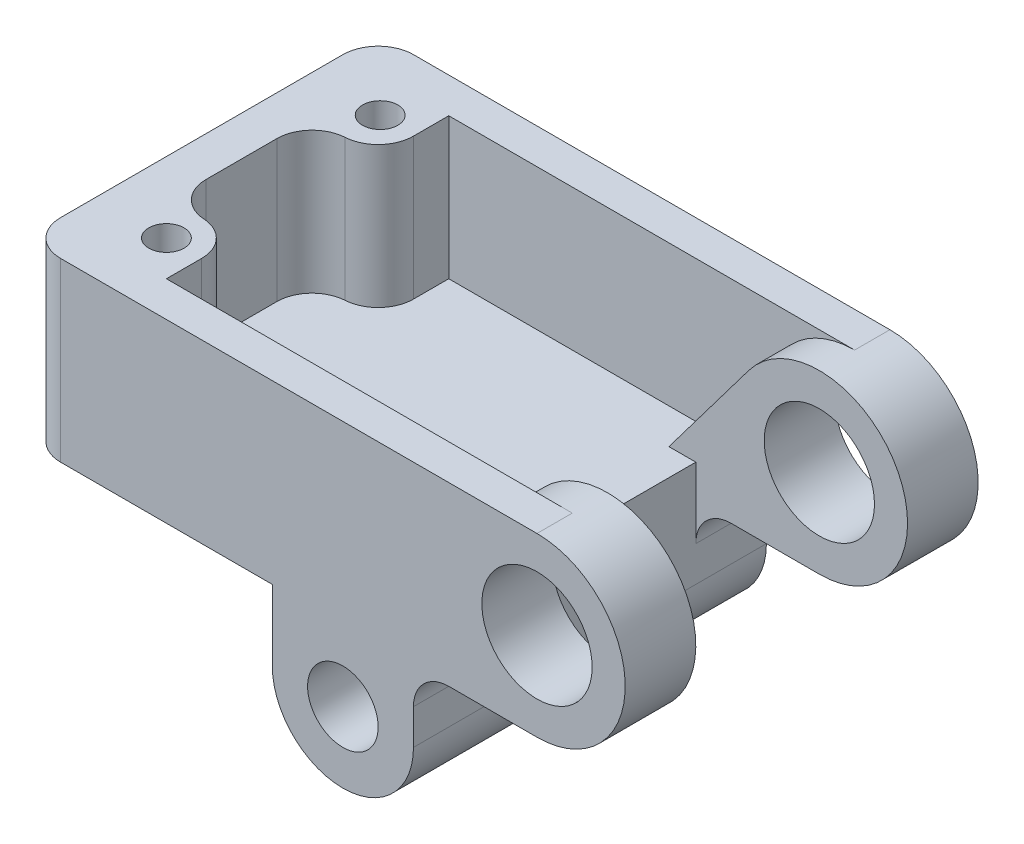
ISO-10303-21;
HEADER;
FILE_DESCRIPTION(('STEP AP214'),'2;1');
FILE_NAME('part.step','',(''),(''),'','','');
FILE_SCHEMA(('AUTOMOTIVE_DESIGN { 1 0 10303 214 1 1 1 1 }'));
ENDSEC;
DATA;
#1=APPLICATION_CONTEXT('core data for automotive mechanical design processes');
#2=APPLICATION_PROTOCOL_DEFINITION('international standard','automotive_design',2000,#1);
#3=PRODUCT_CONTEXT('',#1,'mechanical');
#4=PRODUCT('Part','Part','',(#3));
#5=PRODUCT_RELATED_PRODUCT_CATEGORY('part','',(#4));
#6=PRODUCT_DEFINITION_FORMATION('','',#4);
#7=PRODUCT_DEFINITION_CONTEXT('part definition',#1,'design');
#8=PRODUCT_DEFINITION('design','',#6,#7);
#9=PRODUCT_DEFINITION_SHAPE('','',#8);
#10=(LENGTH_UNIT() NAMED_UNIT(*) SI_UNIT(.MILLI.,.METRE.));
#11=(NAMED_UNIT(*) PLANE_ANGLE_UNIT() SI_UNIT($,.RADIAN.));
#12=(NAMED_UNIT(*) SI_UNIT($,.STERADIAN.) SOLID_ANGLE_UNIT());
#13=UNCERTAINTY_MEASURE_WITH_UNIT(LENGTH_MEASURE(1.E-05),#10,'distance_accuracy_value','');
#14=(GEOMETRIC_REPRESENTATION_CONTEXT(3) GLOBAL_UNCERTAINTY_ASSIGNED_CONTEXT((#13)) GLOBAL_UNIT_ASSIGNED_CONTEXT((#10,
#11,#12)) REPRESENTATION_CONTEXT('',''));
#15=CARTESIAN_POINT('',(0.,0.,0.));
#16=DIRECTION('',(0.,0.,1.));
#17=DIRECTION('',(1.,0.,0.));
#18=AXIS2_PLACEMENT_3D('',#15,#16,#17);
#19=CARTESIAN_POINT('',(0.,40.,40.));
#20=DIRECTION('',(1.,0.,0.));
#21=DIRECTION('',(0.,1.,0.));
#22=AXIS2_PLACEMENT_3D('',#19,#20,#21);
#23=PLANE('',#22);
#24=DIRECTION('',(0.,-1.,0.));
#25=VECTOR('',#24,1.);
#26=CARTESIAN_POINT('',(0.,0.,-16.));
#27=LINE('',#26,#25);
#28=CARTESIAN_POINT('',(0.,16.,-16.));
#29=VERTEX_POINT('',#28);
#30=CARTESIAN_POINT('',(0.,0.,-16.));
#31=VERTEX_POINT('',#30);
#32=EDGE_CURVE('E54',#29,#31,#27,.T.);
#33=ORIENTED_EDGE('',*,*,#32,.F.);
#34=CARTESIAN_POINT('',(0.,16.,0.));
#35=DIRECTION('',(-1.,0.,0.));
#36=DIRECTION('',(0.,1.,0.));
#37=AXIS2_PLACEMENT_3D('',#34,#35,#36);
#38=CIRCLE('',#37,16.);
#39=CARTESIAN_POINT('',(0.,16.,16.));
#40=VERTEX_POINT('',#39);
#41=EDGE_CURVE('E269',#40,#29,#38,.T.);
#42=ORIENTED_EDGE('',*,*,#41,.F.);
#43=DIRECTION('',(0.,1.,0.));
#44=VECTOR('',#43,1.);
#45=CARTESIAN_POINT('',(0.,0.,16.));
#46=LINE('',#45,#44);
#47=CARTESIAN_POINT('',(0.,0.,16.));
#48=VERTEX_POINT('',#47);
#49=EDGE_CURVE('E682',#48,#40,#46,.T.);
#50=ORIENTED_EDGE('',*,*,#49,.F.);
#51=DIRECTION('',(0.,0.,-1.));
#52=VECTOR('',#51,1.);
#53=CARTESIAN_POINT('',(0.,0.,40.));
#54=LINE('',#53,#52);
#55=CARTESIAN_POINT('',(0.,0.,32.));
#56=VERTEX_POINT('',#55);
#57=EDGE_CURVE('E538',#56,#48,#54,.T.);
#58=ORIENTED_EDGE('',*,*,#57,.F.);
#59=DIRECTION('',(0.,-1.,0.));
#60=VECTOR('',#59,1.);
#61=CARTESIAN_POINT('',(0.,40.,32.));
#62=LINE('',#61,#60);
#63=CARTESIAN_POINT('',(0.,40.,32.));
#64=VERTEX_POINT('',#63);
#65=EDGE_CURVE('E548',#56,#64,#62,.F.);
#66=ORIENTED_EDGE('',*,*,#65,.T.);
#67=DIRECTION('',(0.,0.,-1.));
#68=VECTOR('',#67,1.);
#69=CARTESIAN_POINT('',(0.,40.,40.));
#70=LINE('',#69,#68);
#71=CARTESIAN_POINT('',(0.,40.,-32.));
#72=VERTEX_POINT('',#71);
#73=EDGE_CURVE('E541',#64,#72,#70,.T.);
#74=ORIENTED_EDGE('',*,*,#73,.T.);
#75=DIRECTION('',(0.,-1.,0.));
#76=VECTOR('',#75,1.);
#77=CARTESIAN_POINT('',(0.,0.,-32.));
#78=LINE('',#77,#76);
#79=CARTESIAN_POINT('',(0.,0.,-32.));
#80=VERTEX_POINT('',#79);
#81=EDGE_CURVE('E551',#72,#80,#78,.T.);
#82=ORIENTED_EDGE('',*,*,#81,.T.);
#83=EDGE_CURVE('E537',#31,#80,#54,.T.);
#84=ORIENTED_EDGE('',*,*,#83,.F.);
#85=EDGE_LOOP('',(#33,#42,#50,#58,#66,#74,#82,#84));
#86=FACE_BOUND('',#85,.T.);
#87=ADVANCED_FACE('F38',(#86),#23,.F.);
#88=CARTESIAN_POINT('',(0.,40.,40.));
#89=DIRECTION('',(0.,-1.,0.));
#90=DIRECTION('',(1.,0.,0.));
#91=AXIS2_PLACEMENT_3D('',#88,#89,#90);
#92=PLANE('',#91);
#93=CARTESIAN_POINT('',(16.1058529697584,40.,-24.3492724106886));
#94=DIRECTION('',(0.,1.,0.));
#95=DIRECTION('',(0.,0.,1.));
#96=AXIS2_PLACEMENT_3D('',#93,#94,#95);
#97=CIRCLE('',#96,3.99999999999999);
#98=CARTESIAN_POINT('',(16.1058529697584,40.,-20.3492724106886));
#99=VERTEX_POINT('',#98);
#100=EDGE_CURVE('E273',#99,#99,#97,.T.);
#101=ORIENTED_EDGE('',*,*,#100,.F.);
#102=EDGE_LOOP('',(#101));
#103=FACE_BOUND('',#102,.T.);
#104=DIRECTION('',(-1.,0.,0.));
#105=VECTOR('',#104,1.);
#106=CARTESIAN_POINT('',(0.,40.,-40.));
#107=LINE('',#106,#105);
#108=CARTESIAN_POINT('',(116.,40.,-40.));
#109=VERTEX_POINT('',#108);
#110=CARTESIAN_POINT('',(8.,40.,-40.));
#111=VERTEX_POINT('',#110);
#112=EDGE_CURVE('E465',#109,#111,#107,.T.);
#113=ORIENTED_EDGE('',*,*,#112,.T.);
#114=CARTESIAN_POINT('',(8.,40.,-32.));
#115=DIRECTION('',(0.,-1.,0.));
#116=DIRECTION('',(1.,0.,0.));
#117=AXIS2_PLACEMENT_3D('',#114,#115,#116);
#118=CIRCLE('',#117,8.);
#119=EDGE_CURVE('E566',#111,#72,#118,.F.);
#120=ORIENTED_EDGE('',*,*,#119,.T.);
#121=ORIENTED_EDGE('',*,*,#73,.F.);
#122=CARTESIAN_POINT('',(8.00000000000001,40.,32.));
#123=DIRECTION('',(0.,-1.,0.));
#124=DIRECTION('',(1.,0.,0.));
#125=AXIS2_PLACEMENT_3D('',#122,#123,#124);
#126=CIRCLE('',#125,8.);
#127=CARTESIAN_POINT('',(8.00000000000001,40.,40.));
#128=VERTEX_POINT('',#127);
#129=EDGE_CURVE('E563',#64,#128,#126,.F.);
#130=ORIENTED_EDGE('',*,*,#129,.T.);
#131=DIRECTION('',(-1.,0.,0.));
#132=VECTOR('',#131,1.);
#133=CARTESIAN_POINT('',(0.,40.,40.));
#134=LINE('',#133,#132);
#135=CARTESIAN_POINT('',(116.,40.,40.));
#136=VERTEX_POINT('',#135);
#137=EDGE_CURVE('E469',#136,#128,#134,.T.);
#138=ORIENTED_EDGE('',*,*,#137,.F.);
#139=DIRECTION('',(0.,0.,-1.));
#140=VECTOR('',#139,1.);
#141=CARTESIAN_POINT('',(116.,40.,40.));
#142=LINE('',#141,#140);
#143=CARTESIAN_POINT('',(116.,40.,32.));
#144=VERTEX_POINT('',#143);
#145=EDGE_CURVE('E516',#136,#144,#142,.T.);
#146=ORIENTED_EDGE('',*,*,#145,.T.);
#147=DIRECTION('',(1.,0.,0.));
#148=VECTOR('',#147,1.);
#149=CARTESIAN_POINT('',(24.,40.,32.));
#150=LINE('',#149,#148);
#151=CARTESIAN_POINT('',(24.,40.,32.));
#152=VERTEX_POINT('',#151);
#153=EDGE_CURVE('E365',#152,#144,#150,.T.);
#154=ORIENTED_EDGE('',*,*,#153,.F.);
#155=DIRECTION('',(0.,0.,1.));
#156=VECTOR('',#155,1.);
#157=CARTESIAN_POINT('',(24.,40.,24.));
#158=LINE('',#157,#156);
#159=CARTESIAN_POINT('',(24.,40.,24.));
#160=VERTEX_POINT('',#159);
#161=EDGE_CURVE('E425',#160,#152,#158,.T.);
#162=ORIENTED_EDGE('',*,*,#161,.F.);
#163=CARTESIAN_POINT('',(16.,40.,24.));
#164=DIRECTION('',(0.,-1.,0.));
#165=DIRECTION('',(1.,0.,0.));
#166=AXIS2_PLACEMENT_3D('',#163,#164,#165);
#167=CIRCLE('',#166,8.);
#168=CARTESIAN_POINT('',(16.5,40.,16.0156402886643));
#169=VERTEX_POINT('',#168);
#170=EDGE_CURVE('E421',#169,#160,#167,.T.);
#171=ORIENTED_EDGE('',*,*,#170,.F.);
#172=CARTESIAN_POINT('',(17.,40.,8.03128057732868));
#173=DIRECTION('',(0.,1.,0.));
#174=DIRECTION('',(-1.,0.,0.));
#175=AXIS2_PLACEMENT_3D('',#172,#173,#174);
#176=CIRCLE('',#175,8.);
#177=CARTESIAN_POINT('',(9.,40.,8.03128057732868));
#178=VERTEX_POINT('',#177);
#179=EDGE_CURVE('E417',#178,#169,#176,.T.);
#180=ORIENTED_EDGE('',*,*,#179,.F.);
#181=DIRECTION('',(0.,0.,1.));
#182=VECTOR('',#181,1.);
#183=CARTESIAN_POINT('',(9.,40.,-8.03128057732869));
#184=LINE('',#183,#182);
#185=CARTESIAN_POINT('',(9.,40.,-8.03128057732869));
#186=VERTEX_POINT('',#185);
#187=EDGE_CURVE('E413',#186,#178,#184,.T.);
#188=ORIENTED_EDGE('',*,*,#187,.F.);
#189=CARTESIAN_POINT('',(17.,40.,-8.03128057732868));
#190=DIRECTION('',(0.,1.,0.));
#191=DIRECTION('',(1.,0.,0.));
#192=AXIS2_PLACEMENT_3D('',#189,#190,#191);
#193=CIRCLE('',#192,8.);
#194=CARTESIAN_POINT('',(16.5,40.,-16.0156402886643));
#195=VERTEX_POINT('',#194);
#196=EDGE_CURVE('E409',#195,#186,#193,.T.);
#197=ORIENTED_EDGE('',*,*,#196,.F.);
#198=CARTESIAN_POINT('',(16.,40.,-24.));
#199=DIRECTION('',(0.,-1.,0.));
#200=DIRECTION('',(1.,0.,0.));
#201=AXIS2_PLACEMENT_3D('',#198,#199,#200);
#202=CIRCLE('',#201,8.);
#203=CARTESIAN_POINT('',(24.,40.,-24.));
#204=VERTEX_POINT('',#203);
#205=EDGE_CURVE('E405',#204,#195,#202,.T.);
#206=ORIENTED_EDGE('',*,*,#205,.F.);
#207=DIRECTION('',(0.,0.,1.));
#208=VECTOR('',#207,1.);
#209=CARTESIAN_POINT('',(24.,40.,-32.));
#210=LINE('',#209,#208);
#211=CARTESIAN_POINT('',(24.,40.,-32.));
#212=VERTEX_POINT('',#211);
#213=EDGE_CURVE('E401',#212,#204,#210,.T.);
#214=ORIENTED_EDGE('',*,*,#213,.F.);
#215=DIRECTION('',(-1.,0.,0.));
#216=VECTOR('',#215,1.);
#217=CARTESIAN_POINT('',(150.373043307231,40.,-32.));
#218=LINE('',#217,#216);
#219=CARTESIAN_POINT('',(116.,40.,-32.));
#220=VERTEX_POINT('',#219);
#221=EDGE_CURVE('E398',#220,#212,#218,.T.);
#222=ORIENTED_EDGE('',*,*,#221,.F.);
#223=EDGE_CURVE('E493',#220,#109,#142,.T.);
#224=ORIENTED_EDGE('',*,*,#223,.T.);
#225=EDGE_LOOP('',(#113,#120,#121,#130,#138,#146,#154,#162,#171,#180,#188,#197,#206,#214,#222,#224));
#226=FACE_BOUND('',#225,.T.);
#227=CARTESIAN_POINT('',(16.,40.,24.));
#228=DIRECTION('',(0.,1.,0.));
#229=DIRECTION('',(0.,0.,1.));
#230=AXIS2_PLACEMENT_3D('',#227,#228,#229);
#231=CIRCLE('',#230,3.99999999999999);
#232=CARTESIAN_POINT('',(16.,40.,28.));
#233=VERTEX_POINT('',#232);
#234=EDGE_CURVE('E288',#233,#233,#231,.T.);
#235=ORIENTED_EDGE('',*,*,#234,.F.);
#236=EDGE_LOOP('',(#235));
#237=FACE_BOUND('',#236,.T.);
#238=ADVANCED_FACE('F660',(#103,#226,#237),#92,.F.);
#239=CARTESIAN_POINT('',(88.,-16.,40.));
#240=DIRECTION('',(-1.,0.,0.));
#241=DIRECTION('',(0.,0.,1.));
#242=AXIS2_PLACEMENT_3D('',#239,#240,#241);
#243=PLANE('',#242);
#244=DIRECTION('',(0.,1.,0.));
#245=VECTOR('',#244,1.);
#246=CARTESIAN_POINT('',(88.,-16.,-40.));
#247=LINE('',#246,#245);
#248=CARTESIAN_POINT('',(88.,-16.,-40.));
#249=VERTEX_POINT('',#248);
#250=CARTESIAN_POINT('',(88.,-8.,-40.));
#251=VERTEX_POINT('',#250);
#252=EDGE_CURVE('E506',#249,#251,#247,.T.);
#253=ORIENTED_EDGE('',*,*,#252,.T.);
#254=DIRECTION('',(0.,0.,-1.));
#255=VECTOR('',#254,1.);
#256=CARTESIAN_POINT('',(88.,-8.,-24.));
#257=LINE('',#256,#255);
#258=CARTESIAN_POINT('',(88.,-8.,-24.));
#259=VERTEX_POINT('',#258);
#260=EDGE_CURVE('E580',#251,#259,#257,.F.);
#261=ORIENTED_EDGE('',*,*,#260,.T.);
#262=DIRECTION('',(0.,-1.,0.));
#263=VECTOR('',#262,1.);
#264=CARTESIAN_POINT('',(88.,0.,-24.));
#265=LINE('',#264,#263);
#266=CARTESIAN_POINT('',(88.,8.,-24.));
#267=VERTEX_POINT('',#266);
#268=EDGE_CURVE('E333',#267,#259,#265,.T.);
#269=ORIENTED_EDGE('',*,*,#268,.F.);
#270=DIRECTION('',(0.,0.,1.));
#271=VECTOR('',#270,1.);
#272=CARTESIAN_POINT('',(88.,8.,-32.));
#273=LINE('',#272,#271);
#274=CARTESIAN_POINT('',(88.,8.,24.));
#275=VERTEX_POINT('',#274);
#276=EDGE_CURVE('E361',#267,#275,#273,.T.);
#277=ORIENTED_EDGE('',*,*,#276,.T.);
#278=DIRECTION('',(0.,-1.,0.));
#279=VECTOR('',#278,1.);
#280=CARTESIAN_POINT('',(88.,0.,24.));
#281=LINE('',#280,#279);
#282=CARTESIAN_POINT('',(88.,-8.,24.));
#283=VERTEX_POINT('',#282);
#284=EDGE_CURVE('E301',#275,#283,#281,.T.);
#285=ORIENTED_EDGE('',*,*,#284,.T.);
#286=DIRECTION('',(0.,0.,-1.));
#287=VECTOR('',#286,1.);
#288=CARTESIAN_POINT('',(88.,-8.,40.));
#289=LINE('',#288,#287);
#290=CARTESIAN_POINT('',(88.,-8.,40.));
#291=VERTEX_POINT('',#290);
#292=EDGE_CURVE('E577',#283,#291,#289,.F.);
#293=ORIENTED_EDGE('',*,*,#292,.T.);
#294=DIRECTION('',(0.,1.,0.));
#295=VECTOR('',#294,1.);
#296=CARTESIAN_POINT('',(88.,-16.,40.));
#297=LINE('',#296,#295);
#298=CARTESIAN_POINT('',(88.,-16.,40.));
#299=VERTEX_POINT('',#298);
#300=EDGE_CURVE('E483',#299,#291,#297,.T.);
#301=ORIENTED_EDGE('',*,*,#300,.F.);
#302=DIRECTION('',(0.,0.,-1.));
#303=VECTOR('',#302,1.);
#304=CARTESIAN_POINT('',(88.,-16.,40.));
#305=LINE('',#304,#303);
#306=EDGE_CURVE('E525',#299,#249,#305,.T.);
#307=ORIENTED_EDGE('',*,*,#306,.T.);
#308=EDGE_LOOP('',(#253,#261,#269,#277,#285,#293,#301,#307));
#309=FACE_BOUND('',#308,.T.);
#310=ADVANCED_FACE('F603',(#309),#243,.F.);
#311=CARTESIAN_POINT('',(150.373043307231,-155.18484904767,-32.));
#312=DIRECTION('',(0.,0.,-1.));
#313=DIRECTION('',(-1.,0.,0.));
#314=AXIS2_PLACEMENT_3D('',#311,#312,#313);
#315=PLANE('',#314);
#316=CARTESIAN_POINT('',(116.,20.,-32.));
#317=DIRECTION('',(0.,0.,1.));
#318=DIRECTION('',(-1.,0.,0.));
#319=AXIS2_PLACEMENT_3D('',#316,#317,#318);
#320=CIRCLE('',#319,20.);
#321=CARTESIAN_POINT('',(100.027289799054,32.0363004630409,-32.));
#322=VERTEX_POINT('',#321);
#323=EDGE_CURVE('E332',#220,#322,#320,.T.);
#324=ORIENTED_EDGE('',*,*,#323,.F.);
#325=ORIENTED_EDGE('',*,*,#221,.T.);
#326=DIRECTION('',(0.,1.,0.));
#327=VECTOR('',#326,1.);
#328=CARTESIAN_POINT('',(24.,-155.18484904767,-32.));
#329=LINE('',#328,#327);
#330=CARTESIAN_POINT('',(24.,8.00000000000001,-32.));
#331=VERTEX_POINT('',#330);
#332=EDGE_CURVE('E429',#331,#212,#329,.T.);
#333=ORIENTED_EDGE('',*,*,#332,.F.);
#334=DIRECTION('',(1.,0.,0.));
#335=VECTOR('',#334,1.);
#336=CARTESIAN_POINT('',(150.373043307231,8.00000000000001,-32.));
#337=LINE('',#336,#335);
#338=CARTESIAN_POINT('',(81.914638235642,8.00000000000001,-32.));
#339=VERTEX_POINT('',#338);
#340=EDGE_CURVE('E366',#331,#339,#337,.T.);
#341=ORIENTED_EDGE('',*,*,#340,.T.);
#342=DIRECTION('',(-0.601815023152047,-0.798635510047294,0.));
#343=VECTOR('',#342,1.);
#344=CARTESIAN_POINT('',(81.914638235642,8.,-32.));
#345=LINE('',#344,#343);
#346=EDGE_CURVE('E337',#322,#339,#345,.T.);
#347=ORIENTED_EDGE('',*,*,#346,.F.);
#348=EDGE_LOOP('',(#324,#325,#333,#341,#347));
#349=FACE_BOUND('',#348,.T.);
#350=ADVANCED_FACE('F768',(#349),#315,.F.);
#351=CARTESIAN_POINT('',(0.,8.,40.));
#352=DIRECTION('',(0.,1.,0.));
#353=DIRECTION('',(0.,0.,1.));
#354=AXIS2_PLACEMENT_3D('',#351,#352,#353);
#355=PLANE('',#354);
#356=DIRECTION('',(0.,0.,1.));
#357=VECTOR('',#356,1.);
#358=CARTESIAN_POINT('',(81.914638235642,8.,24.));
#359=LINE('',#358,#357);
#360=CARTESIAN_POINT('',(81.914638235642,8.,24.));
#361=VERTEX_POINT('',#360);
#362=CARTESIAN_POINT('',(81.914638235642,8.00000000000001,32.));
#363=VERTEX_POINT('',#362);
#364=EDGE_CURVE('E324',#361,#363,#359,.T.);
#365=ORIENTED_EDGE('',*,*,#364,.F.);
#366=DIRECTION('',(1.,0.,0.));
#367=VECTOR('',#366,1.);
#368=CARTESIAN_POINT('',(81.914638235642,8.,24.));
#369=LINE('',#368,#367);
#370=EDGE_CURVE('E304',#361,#275,#369,.T.);
#371=ORIENTED_EDGE('',*,*,#370,.T.);
#372=ORIENTED_EDGE('',*,*,#276,.F.);
#373=DIRECTION('',(1.,0.,0.));
#374=VECTOR('',#373,1.);
#375=CARTESIAN_POINT('',(81.914638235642,8.,-24.));
#376=LINE('',#375,#374);
#377=CARTESIAN_POINT('',(81.914638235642,8.,-24.));
#378=VERTEX_POINT('',#377);
#379=EDGE_CURVE('E346',#378,#267,#376,.T.);
#380=ORIENTED_EDGE('',*,*,#379,.F.);
#381=DIRECTION('',(0.,0.,-1.));
#382=VECTOR('',#381,1.);
#383=CARTESIAN_POINT('',(81.914638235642,8.,-24.));
#384=LINE('',#383,#382);
#385=EDGE_CURVE('E349',#378,#339,#384,.T.);
#386=ORIENTED_EDGE('',*,*,#385,.T.);
#387=ORIENTED_EDGE('',*,*,#340,.F.);
#388=DIRECTION('',(0.,0.,-1.));
#389=VECTOR('',#388,1.);
#390=CARTESIAN_POINT('',(24.,8.00000000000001,-32.));
#391=LINE('',#390,#389);
#392=CARTESIAN_POINT('',(24.,8.00000000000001,-24.));
#393=VERTEX_POINT('',#392);
#394=EDGE_CURVE('E370',#393,#331,#391,.T.);
#395=ORIENTED_EDGE('',*,*,#394,.F.);
#396=CARTESIAN_POINT('',(16.,8.00000000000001,-24.));
#397=DIRECTION('',(0.,1.,0.));
#398=DIRECTION('',(0.,0.,1.));
#399=AXIS2_PLACEMENT_3D('',#396,#397,#398);
#400=CIRCLE('',#399,8.);
#401=CARTESIAN_POINT('',(16.5,8.00000000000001,-16.0156402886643));
#402=VERTEX_POINT('',#401);
#403=EDGE_CURVE('E374',#402,#393,#400,.T.);
#404=ORIENTED_EDGE('',*,*,#403,.F.);
#405=CARTESIAN_POINT('',(17.,8.00000000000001,-8.03128057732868));
#406=DIRECTION('',(0.,1.,0.));
#407=DIRECTION('',(0.,0.,1.));
#408=AXIS2_PLACEMENT_3D('',#405,#406,#407);
#409=CIRCLE('',#408,8.);
#410=CARTESIAN_POINT('',(9.,8.00000000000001,-8.03128057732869));
#411=VERTEX_POINT('',#410);
#412=EDGE_CURVE('E377',#411,#402,#409,.F.);
#413=ORIENTED_EDGE('',*,*,#412,.F.);
#414=DIRECTION('',(0.,0.,-1.));
#415=VECTOR('',#414,1.);
#416=CARTESIAN_POINT('',(9.,8.00000000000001,-8.03128057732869));
#417=LINE('',#416,#415);
#418=CARTESIAN_POINT('',(9.00000000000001,8.00000000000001,8.03128057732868));
#419=VERTEX_POINT('',#418);
#420=EDGE_CURVE('E380',#419,#411,#417,.T.);
#421=ORIENTED_EDGE('',*,*,#420,.F.);
#422=CARTESIAN_POINT('',(17.,8.00000000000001,8.03128057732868));
#423=DIRECTION('',(0.,1.,0.));
#424=DIRECTION('',(0.,0.,1.));
#425=AXIS2_PLACEMENT_3D('',#422,#423,#424);
#426=CIRCLE('',#425,8.);
#427=CARTESIAN_POINT('',(16.5,8.00000000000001,16.0156402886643));
#428=VERTEX_POINT('',#427);
#429=EDGE_CURVE('E383',#428,#419,#426,.F.);
#430=ORIENTED_EDGE('',*,*,#429,.F.);
#431=CARTESIAN_POINT('',(16.,8.00000000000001,24.));
#432=DIRECTION('',(0.,1.,0.));
#433=DIRECTION('',(0.,0.,1.));
#434=AXIS2_PLACEMENT_3D('',#431,#432,#433);
#435=CIRCLE('',#434,8.);
#436=CARTESIAN_POINT('',(24.,8.00000000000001,24.));
#437=VERTEX_POINT('',#436);
#438=EDGE_CURVE('E386',#437,#428,#435,.T.);
#439=ORIENTED_EDGE('',*,*,#438,.F.);
#440=DIRECTION('',(0.,0.,-1.));
#441=VECTOR('',#440,1.);
#442=CARTESIAN_POINT('',(24.,8.00000000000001,24.));
#443=LINE('',#442,#441);
#444=CARTESIAN_POINT('',(24.,8.00000000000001,32.));
#445=VERTEX_POINT('',#444);
#446=EDGE_CURVE('E389',#445,#437,#443,.T.);
#447=ORIENTED_EDGE('',*,*,#446,.F.);
#448=DIRECTION('',(-1.,0.,0.));
#449=VECTOR('',#448,1.);
#450=CARTESIAN_POINT('',(24.,8.00000000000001,32.));
#451=LINE('',#450,#449);
#452=EDGE_CURVE('E392',#363,#445,#451,.T.);
#453=ORIENTED_EDGE('',*,*,#452,.F.);
#454=EDGE_LOOP('',(#365,#371,#372,#380,#386,#387,#395,#404,#413,#421,#430,#439,#447,#453));
#455=FACE_BOUND('',#454,.T.);
#456=ADVANCED_FACE('F642',(#455),#355,.T.);
#457=CARTESIAN_POINT('',(116.,20.,40.));
#458=DIRECTION('',(0.,0.,-1.));
#459=DIRECTION('',(-1.,0.,0.));
#460=AXIS2_PLACEMENT_3D('',#457,#458,#459);
#461=CYLINDRICAL_SURFACE('',#460,12.5);
#462=CARTESIAN_POINT('',(116.,20.,-40.));
#463=DIRECTION('',(0.,0.,1.));
#464=DIRECTION('',(1.,0.,0.));
#465=AXIS2_PLACEMENT_3D('',#462,#463,#464);
#466=CIRCLE('',#465,12.5);
#467=CARTESIAN_POINT('',(128.5,20.,-40.));
#468=VERTEX_POINT('',#467);
#469=EDGE_CURVE('E395',#468,#468,#466,.T.);
#470=ORIENTED_EDGE('',*,*,#469,.F.);
#471=EDGE_LOOP('',(#470));
#472=FACE_BOUND('',#471,.T.);
#473=CARTESIAN_POINT('',(116.,20.,-24.));
#474=DIRECTION('',(0.,0.,1.));
#475=DIRECTION('',(1.,0.,0.));
#476=AXIS2_PLACEMENT_3D('',#473,#474,#475);
#477=CIRCLE('',#476,12.5);
#478=CARTESIAN_POINT('',(128.5,20.,-24.));
#479=VERTEX_POINT('',#478);
#480=EDGE_CURVE('E328',#479,#479,#477,.T.);
#481=ORIENTED_EDGE('',*,*,#480,.T.);
#482=EDGE_LOOP('',(#481));
#483=FACE_BOUND('',#482,.T.);
#484=ADVANCED_FACE('F767',(#472,#483),#461,.F.);
#485=CARTESIAN_POINT('',(116.,0.,40.));
#486=DIRECTION('',(0.,1.,0.));
#487=DIRECTION('',(0.,0.,1.));
#488=AXIS2_PLACEMENT_3D('',#485,#486,#487);
#489=PLANE('',#488);
#490=DIRECTION('',(1.,0.,0.));
#491=VECTOR('',#490,1.);
#492=CARTESIAN_POINT('',(88.,0.,-24.));
#493=LINE('',#492,#491);
#494=CARTESIAN_POINT('',(96.,0.,-24.));
#495=VERTEX_POINT('',#494);
#496=CARTESIAN_POINT('',(116.,0.,-24.));
#497=VERTEX_POINT('',#496);
#498=EDGE_CURVE('E336',#495,#497,#493,.T.);
#499=ORIENTED_EDGE('',*,*,#498,.F.);
#500=DIRECTION('',(0.,0.,-1.));
#501=VECTOR('',#500,1.);
#502=CARTESIAN_POINT('',(96.,0.,-40.));
#503=LINE('',#502,#501);
#504=CARTESIAN_POINT('',(96.,0.,-40.));
#505=VERTEX_POINT('',#504);
#506=EDGE_CURVE('E573',#495,#505,#503,.T.);
#507=ORIENTED_EDGE('',*,*,#506,.T.);
#508=DIRECTION('',(1.,0.,0.));
#509=VECTOR('',#508,1.);
#510=CARTESIAN_POINT('',(116.,0.,-40.));
#511=LINE('',#510,#509);
#512=CARTESIAN_POINT('',(116.,0.,-40.));
#513=VERTEX_POINT('',#512);
#514=EDGE_CURVE('E510',#505,#513,#511,.T.);
#515=ORIENTED_EDGE('',*,*,#514,.T.);
#516=DIRECTION('',(0.,0.,-1.));
#517=VECTOR('',#516,1.);
#518=CARTESIAN_POINT('',(116.,0.,40.));
#519=LINE('',#518,#517);
#520=EDGE_CURVE('E520',#497,#513,#519,.T.);
#521=ORIENTED_EDGE('',*,*,#520,.F.);
#522=EDGE_LOOP('',(#499,#507,#515,#521));
#523=FACE_BOUND('',#522,.T.);
#524=ADVANCED_FACE('F630',(#523),#489,.F.);
#525=CARTESIAN_POINT('',(116.,20.,40.));
#526=DIRECTION('',(0.,0.,-1.));
#527=DIRECTION('',(-1.,0.,0.));
#528=AXIS2_PLACEMENT_3D('',#525,#526,#527);
#529=CYLINDRICAL_SURFACE('',#528,20.);
#530=ORIENTED_EDGE('',*,*,#223,.F.);
#531=ORIENTED_EDGE('',*,*,#323,.T.);
#532=DIRECTION('',(0.,0.,-1.));
#533=VECTOR('',#532,1.);
#534=CARTESIAN_POINT('',(100.027289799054,32.0363004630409,-24.));
#535=LINE('',#534,#533);
#536=CARTESIAN_POINT('',(100.027289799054,32.0363004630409,-24.));
#537=VERTEX_POINT('',#536);
#538=EDGE_CURVE('E357',#537,#322,#535,.T.);
#539=ORIENTED_EDGE('',*,*,#538,.F.);
#540=CARTESIAN_POINT('',(116.,20.,-24.));
#541=DIRECTION('',(0.,0.,1.));
#542=DIRECTION('',(1.,0.,0.));
#543=AXIS2_PLACEMENT_3D('',#540,#541,#542);
#544=CIRCLE('',#543,20.);
#545=EDGE_CURVE('E340',#497,#537,#544,.T.);
#546=ORIENTED_EDGE('',*,*,#545,.F.);
#547=ORIENTED_EDGE('',*,*,#520,.T.);
#548=CARTESIAN_POINT('',(116.,20.,-40.));
#549=DIRECTION('',(0.,0.,1.));
#550=DIRECTION('',(-1.,0.,0.));
#551=AXIS2_PLACEMENT_3D('',#548,#549,#550);
#552=CIRCLE('',#551,20.);
#553=EDGE_CURVE('E474',#513,#109,#552,.T.);
#554=ORIENTED_EDGE('',*,*,#553,.T.);
#555=EDGE_LOOP('',(#530,#531,#539,#546,#547,#554));
#556=FACE_BOUND('',#555,.T.);
#557=ADVANCED_FACE('F807',(#556),#529,.T.);
#558=CARTESIAN_POINT('',(116.,20.,40.));
#559=DIRECTION('',(0.,0.,1.));
#560=DIRECTION('',(1.,0.,0.));
#561=AXIS2_PLACEMENT_3D('',#558,#559,#560);
#562=CIRCLE('',#561,12.5);
#563=CARTESIAN_POINT('',(128.5,20.,40.));
#564=VERTEX_POINT('',#563);
#565=EDGE_CURVE('E453',#564,#564,#562,.T.);
#566=ORIENTED_EDGE('',*,*,#565,.T.);
#567=EDGE_LOOP('',(#566));
#568=FACE_BOUND('',#567,.T.);
#569=CARTESIAN_POINT('',(116.,20.,24.));
#570=DIRECTION('',(0.,0.,1.));
#571=DIRECTION('',(1.,0.,0.));
#572=AXIS2_PLACEMENT_3D('',#569,#570,#571);
#573=CIRCLE('',#572,12.5);
#574=CARTESIAN_POINT('',(128.5,20.,24.));
#575=VERTEX_POINT('',#574);
#576=EDGE_CURVE('E296',#575,#575,#573,.T.);
#577=ORIENTED_EDGE('',*,*,#576,.F.);
#578=EDGE_LOOP('',(#577));
#579=FACE_BOUND('',#578,.T.);
#580=ADVANCED_FACE('F804',(#568,#579),#461,.F.);
#581=CARTESIAN_POINT('',(116.,20.,40.));
#582=DIRECTION('',(0.,0.,-1.));
#583=DIRECTION('',(-1.,0.,0.));
#584=AXIS2_PLACEMENT_3D('',#581,#582,#583);
#585=PLANE('',#584);
#586=CARTESIAN_POINT('',(72.,-16.,40.));
#587=DIRECTION('',(0.,0.,1.));
#588=DIRECTION('',(1.,0.,0.));
#589=AXIS2_PLACEMENT_3D('',#586,#587,#588);
#590=CIRCLE('',#589,8.);
#591=CARTESIAN_POINT('',(80.,-16.,40.));
#592=VERTEX_POINT('',#591);
#593=EDGE_CURVE('E461',#592,#592,#590,.T.);
#594=ORIENTED_EDGE('',*,*,#593,.F.);
#595=EDGE_LOOP('',(#594));
#596=FACE_BOUND('',#595,.T.);
#597=ORIENTED_EDGE('',*,*,#137,.T.);
#598=DIRECTION('',(0.,-1.,0.));
#599=VECTOR('',#598,1.);
#600=CARTESIAN_POINT('',(8.00000000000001,20.,40.));
#601=LINE('',#600,#599);
#602=CARTESIAN_POINT('',(8.,0.,40.));
#603=VERTEX_POINT('',#602);
#604=EDGE_CURVE('E569',#128,#603,#601,.T.);
#605=ORIENTED_EDGE('',*,*,#604,.T.);
#606=DIRECTION('',(1.,0.,0.));
#607=VECTOR('',#606,1.);
#608=CARTESIAN_POINT('',(0.,0.,40.));
#609=LINE('',#608,#607);
#610=CARTESIAN_POINT('',(56.,0.,40.));
#611=VERTEX_POINT('',#610);
#612=EDGE_CURVE('E473',#603,#611,#609,.T.);
#613=ORIENTED_EDGE('',*,*,#612,.T.);
#614=DIRECTION('',(0.,-1.,0.));
#615=VECTOR('',#614,1.);
#616=CARTESIAN_POINT('',(56.,0.,40.));
#617=LINE('',#616,#615);
#618=CARTESIAN_POINT('',(56.,-16.,40.));
#619=VERTEX_POINT('',#618);
#620=EDGE_CURVE('E477',#611,#619,#617,.T.);
#621=ORIENTED_EDGE('',*,*,#620,.T.);
#622=CARTESIAN_POINT('',(72.,-16.,40.));
#623=DIRECTION('',(0.,0.,1.));
#624=DIRECTION('',(1.,0.,0.));
#625=AXIS2_PLACEMENT_3D('',#622,#623,#624);
#626=CIRCLE('',#625,16.);
#627=EDGE_CURVE('E480',#619,#299,#626,.T.);
#628=ORIENTED_EDGE('',*,*,#627,.T.);
#629=ORIENTED_EDGE('',*,*,#300,.T.);
#630=CARTESIAN_POINT('',(96.,-8.,40.));
#631=DIRECTION('',(0.,0.,-1.));
#632=DIRECTION('',(-1.,0.,0.));
#633=AXIS2_PLACEMENT_3D('',#630,#631,#632);
#634=CIRCLE('',#633,8.);
#635=CARTESIAN_POINT('',(96.,0.,40.));
#636=VERTEX_POINT('',#635);
#637=EDGE_CURVE('E12',#291,#636,#634,.T.);
#638=ORIENTED_EDGE('',*,*,#637,.T.);
#639=DIRECTION('',(1.,0.,0.));
#640=VECTOR('',#639,1.);
#641=CARTESIAN_POINT('',(116.,0.,40.));
#642=LINE('',#641,#640);
#643=CARTESIAN_POINT('',(116.,0.,40.));
#644=VERTEX_POINT('',#643);
#645=EDGE_CURVE('E487',#636,#644,#642,.T.);
#646=ORIENTED_EDGE('',*,*,#645,.T.);
#647=CARTESIAN_POINT('',(116.,20.,40.));
#648=DIRECTION('',(0.,0.,1.));
#649=DIRECTION('',(-1.,0.,0.));
#650=AXIS2_PLACEMENT_3D('',#647,#648,#649);
#651=CIRCLE('',#650,20.);
#652=EDGE_CURVE('E490',#644,#136,#651,.T.);
#653=ORIENTED_EDGE('',*,*,#652,.T.);
#654=EDGE_LOOP('',(#597,#605,#613,#621,#628,#629,#638,#646,#653));
#655=FACE_BOUND('',#654,.T.);
#656=ORIENTED_EDGE('',*,*,#565,.F.);
#657=EDGE_LOOP('',(#656));
#658=FACE_BOUND('',#657,.T.);
#659=ADVANCED_FACE('F605',(#596,#655,#658),#585,.F.);
#660=CARTESIAN_POINT('',(116.,20.,-40.));
#661=DIRECTION('',(0.,0.,-1.));
#662=DIRECTION('',(-1.,0.,0.));
#663=AXIS2_PLACEMENT_3D('',#660,#661,#662);
#664=PLANE('',#663);
#665=CARTESIAN_POINT('',(72.,-16.,-40.));
#666=DIRECTION('',(0.,0.,1.));
#667=DIRECTION('',(1.,0.,0.));
#668=AXIS2_PLACEMENT_3D('',#665,#666,#667);
#669=CIRCLE('',#668,8.);
#670=CARTESIAN_POINT('',(80.,-16.,-40.));
#671=VERTEX_POINT('',#670);
#672=EDGE_CURVE('E457',#671,#671,#669,.T.);
#673=ORIENTED_EDGE('',*,*,#672,.T.);
#674=EDGE_LOOP('',(#673));
#675=FACE_BOUND('',#674,.T.);
#676=DIRECTION('',(1.,0.,0.));
#677=VECTOR('',#676,1.);
#678=CARTESIAN_POINT('',(0.,0.,-40.));
#679=LINE('',#678,#677);
#680=CARTESIAN_POINT('',(8.,0.,-40.));
#681=VERTEX_POINT('',#680);
#682=CARTESIAN_POINT('',(56.,0.,-40.));
#683=VERTEX_POINT('',#682);
#684=EDGE_CURVE('E497',#681,#683,#679,.T.);
#685=ORIENTED_EDGE('',*,*,#684,.F.);
#686=DIRECTION('',(0.,-1.,0.));
#687=VECTOR('',#686,1.);
#688=CARTESIAN_POINT('',(8.,40.,-40.));
#689=LINE('',#688,#687);
#690=EDGE_CURVE('E560',#681,#111,#689,.F.);
#691=ORIENTED_EDGE('',*,*,#690,.T.);
#692=ORIENTED_EDGE('',*,*,#112,.F.);
#693=ORIENTED_EDGE('',*,*,#553,.F.);
#694=ORIENTED_EDGE('',*,*,#514,.F.);
#695=CARTESIAN_POINT('',(96.,-8.,-40.));
#696=DIRECTION('',(0.,0.,-1.));
#697=DIRECTION('',(-1.,0.,0.));
#698=AXIS2_PLACEMENT_3D('',#695,#696,#697);
#699=CIRCLE('',#698,8.);
#700=EDGE_CURVE('E587',#505,#251,#699,.F.);
#701=ORIENTED_EDGE('',*,*,#700,.T.);
#702=ORIENTED_EDGE('',*,*,#252,.F.);
#703=CARTESIAN_POINT('',(72.,-16.,-40.));
#704=DIRECTION('',(0.,0.,1.));
#705=DIRECTION('',(1.,0.,0.));
#706=AXIS2_PLACEMENT_3D('',#703,#704,#705);
#707=CIRCLE('',#706,16.);
#708=CARTESIAN_POINT('',(56.,-16.,-40.));
#709=VERTEX_POINT('',#708);
#710=EDGE_CURVE('E503',#709,#249,#707,.T.);
#711=ORIENTED_EDGE('',*,*,#710,.F.);
#712=DIRECTION('',(0.,-1.,0.));
#713=VECTOR('',#712,1.);
#714=CARTESIAN_POINT('',(56.,0.,-40.));
#715=LINE('',#714,#713);
#716=EDGE_CURVE('E500',#683,#709,#715,.T.);
#717=ORIENTED_EDGE('',*,*,#716,.F.);
#718=EDGE_LOOP('',(#685,#691,#692,#693,#694,#701,#702,#711,#717));
#719=FACE_BOUND('',#718,.T.);
#720=ORIENTED_EDGE('',*,*,#469,.T.);
#721=EDGE_LOOP('',(#720));
#722=FACE_BOUND('',#721,.T.);
#723=ADVANCED_FACE('F619',(#675,#719,#722),#664,.T.);
#724=CARTESIAN_POINT('',(0.,0.,40.));
#725=DIRECTION('',(0.,1.,0.));
#726=DIRECTION('',(0.,0.,1.));
#727=AXIS2_PLACEMENT_3D('',#724,#725,#726);
#728=PLANE('',#727);
#729=CARTESIAN_POINT('',(16.1058529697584,0.,-24.3492724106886));
#730=DIRECTION('',(0.,1.,0.));
#731=DIRECTION('',(0.,0.,1.));
#732=AXIS2_PLACEMENT_3D('',#729,#730,#731);
#733=CIRCLE('',#732,3.99999999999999);
#734=CARTESIAN_POINT('',(16.1058529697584,0.,-20.3492724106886));
#735=VERTEX_POINT('',#734);
#736=EDGE_CURVE('E279',#735,#735,#733,.T.);
#737=ORIENTED_EDGE('',*,*,#736,.T.);
#738=EDGE_LOOP('',(#737));
#739=FACE_BOUND('',#738,.T.);
#740=CARTESIAN_POINT('',(16.,0.,24.));
#741=DIRECTION('',(0.,1.,0.));
#742=DIRECTION('',(0.,0.,1.));
#743=AXIS2_PLACEMENT_3D('',#740,#741,#742);
#744=CIRCLE('',#743,3.99999999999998);
#745=CARTESIAN_POINT('',(16.,0.,28.));
#746=VERTEX_POINT('',#745);
#747=EDGE_CURVE('E292',#746,#746,#744,.T.);
#748=ORIENTED_EDGE('',*,*,#747,.T.);
#749=EDGE_LOOP('',(#748));
#750=FACE_BOUND('',#749,.T.);
#751=ORIENTED_EDGE('',*,*,#57,.T.);
#752=DIRECTION('',(1.,0.,0.));
#753=VECTOR('',#752,1.);
#754=CARTESIAN_POINT('',(-8.,0.,16.));
#755=LINE('',#754,#753);
#756=CARTESIAN_POINT('',(-8.,0.,16.));
#757=VERTEX_POINT('',#756);
#758=EDGE_CURVE('E255',#757,#48,#755,.T.);
#759=ORIENTED_EDGE('',*,*,#758,.F.);
#760=DIRECTION('',(0.,0.,1.));
#761=VECTOR('',#760,1.);
#762=CARTESIAN_POINT('',(-8.,0.,-16.));
#763=LINE('',#762,#761);
#764=CARTESIAN_POINT('',(-8.,0.,-16.));
#765=VERTEX_POINT('',#764);
#766=EDGE_CURVE('E249',#765,#757,#763,.T.);
#767=ORIENTED_EDGE('',*,*,#766,.F.);
#768=DIRECTION('',(1.,0.,0.));
#769=VECTOR('',#768,1.);
#770=CARTESIAN_POINT('',(-8.,0.,-16.));
#771=LINE('',#770,#769);
#772=EDGE_CURVE('E253',#765,#31,#771,.T.);
#773=ORIENTED_EDGE('',*,*,#772,.T.);
#774=ORIENTED_EDGE('',*,*,#83,.T.);
#775=CARTESIAN_POINT('',(8.,0.,-32.));
#776=DIRECTION('',(0.,1.,0.));
#777=DIRECTION('',(0.,0.,1.));
#778=AXIS2_PLACEMENT_3D('',#775,#776,#777);
#779=CIRCLE('',#778,8.);
#780=EDGE_CURVE('E557',#80,#681,#779,.F.);
#781=ORIENTED_EDGE('',*,*,#780,.T.);
#782=ORIENTED_EDGE('',*,*,#684,.T.);
#783=DIRECTION('',(0.,0.,-1.));
#784=VECTOR('',#783,1.);
#785=CARTESIAN_POINT('',(56.,0.,40.));
#786=LINE('',#785,#784);
#787=EDGE_CURVE('E533',#611,#683,#786,.T.);
#788=ORIENTED_EDGE('',*,*,#787,.F.);
#789=ORIENTED_EDGE('',*,*,#612,.F.);
#790=CARTESIAN_POINT('',(8.00000000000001,0.,32.));
#791=DIRECTION('',(0.,1.,0.));
#792=DIRECTION('',(0.,0.,1.));
#793=AXIS2_PLACEMENT_3D('',#790,#791,#792);
#794=CIRCLE('',#793,8.);
#795=EDGE_CURVE('E555',#603,#56,#794,.F.);
#796=ORIENTED_EDGE('',*,*,#795,.T.);
#797=EDGE_LOOP('',(#751,#759,#767,#773,#774,#781,#782,#788,#789,#796));
#798=FACE_BOUND('',#797,.T.);
#799=ADVANCED_FACE('F252',(#739,#750,#798),#728,.F.);
#800=CARTESIAN_POINT('',(56.,0.,40.));
#801=DIRECTION('',(1.,0.,0.));
#802=DIRECTION('',(0.,1.,0.));
#803=AXIS2_PLACEMENT_3D('',#800,#801,#802);
#804=PLANE('',#803);
#805=ORIENTED_EDGE('',*,*,#716,.T.);
#806=DIRECTION('',(0.,0.,-1.));
#807=VECTOR('',#806,1.);
#808=CARTESIAN_POINT('',(56.,-16.,40.));
#809=LINE('',#808,#807);
#810=EDGE_CURVE('E529',#619,#709,#809,.T.);
#811=ORIENTED_EDGE('',*,*,#810,.F.);
#812=ORIENTED_EDGE('',*,*,#620,.F.);
#813=ORIENTED_EDGE('',*,*,#787,.T.);
#814=EDGE_LOOP('',(#805,#811,#812,#813));
#815=FACE_BOUND('',#814,.T.);
#816=ADVANCED_FACE('F671',(#815),#804,.F.);
#817=CARTESIAN_POINT('',(72.,-16.,40.));
#818=DIRECTION('',(0.,0.,-1.));
#819=DIRECTION('',(-1.,0.,0.));
#820=AXIS2_PLACEMENT_3D('',#817,#818,#819);
#821=CYLINDRICAL_SURFACE('',#820,16.);
#822=ORIENTED_EDGE('',*,*,#710,.T.);
#823=ORIENTED_EDGE('',*,*,#306,.F.);
#824=ORIENTED_EDGE('',*,*,#627,.F.);
#825=ORIENTED_EDGE('',*,*,#810,.T.);
#826=EDGE_LOOP('',(#822,#823,#824,#825));
#827=FACE_BOUND('',#826,.T.);
#828=ADVANCED_FACE('F613',(#827),#821,.T.);
#829=ORIENTED_EDGE('',*,*,#645,.F.);
#830=DIRECTION('',(0.,0.,-1.));
#831=VECTOR('',#830,1.);
#832=CARTESIAN_POINT('',(96.,0.,24.));
#833=LINE('',#832,#831);
#834=CARTESIAN_POINT('',(96.,0.,24.));
#835=VERTEX_POINT('',#834);
#836=EDGE_CURVE('E584',#636,#835,#833,.T.);
#837=ORIENTED_EDGE('',*,*,#836,.T.);
#838=DIRECTION('',(1.,0.,0.));
#839=VECTOR('',#838,1.);
#840=CARTESIAN_POINT('',(88.,0.,24.));
#841=LINE('',#840,#839);
#842=CARTESIAN_POINT('',(116.,0.,24.));
#843=VERTEX_POINT('',#842);
#844=EDGE_CURVE('E315',#835,#843,#841,.T.);
#845=ORIENTED_EDGE('',*,*,#844,.T.);
#846=EDGE_CURVE('E521',#644,#843,#519,.T.);
#847=ORIENTED_EDGE('',*,*,#846,.F.);
#848=EDGE_LOOP('',(#829,#837,#845,#847));
#849=FACE_BOUND('',#848,.T.);
#850=ADVANCED_FACE('F655',(#849),#489,.F.);
#851=ORIENTED_EDGE('',*,*,#846,.T.);
#852=CARTESIAN_POINT('',(116.,20.,24.));
#853=DIRECTION('',(0.,0.,1.));
#854=DIRECTION('',(-1.,0.,0.));
#855=AXIS2_PLACEMENT_3D('',#852,#853,#854);
#856=CIRCLE('',#855,20.);
#857=CARTESIAN_POINT('',(100.027289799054,32.0363004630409,24.));
#858=VERTEX_POINT('',#857);
#859=EDGE_CURVE('E311',#843,#858,#856,.T.);
#860=ORIENTED_EDGE('',*,*,#859,.T.);
#861=DIRECTION('',(0.,0.,1.));
#862=VECTOR('',#861,1.);
#863=CARTESIAN_POINT('',(100.027289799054,32.0363004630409,24.));
#864=LINE('',#863,#862);
#865=CARTESIAN_POINT('',(100.027289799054,32.036300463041,32.));
#866=VERTEX_POINT('',#865);
#867=EDGE_CURVE('E318',#858,#866,#864,.T.);
#868=ORIENTED_EDGE('',*,*,#867,.T.);
#869=CARTESIAN_POINT('',(116.,20.,32.));
#870=DIRECTION('',(0.,0.,1.));
#871=DIRECTION('',(1.,0.,0.));
#872=AXIS2_PLACEMENT_3D('',#869,#870,#871);
#873=CIRCLE('',#872,20.);
#874=EDGE_CURVE('E545',#144,#866,#873,.T.);
#875=ORIENTED_EDGE('',*,*,#874,.F.);
#876=ORIENTED_EDGE('',*,*,#145,.F.);
#877=ORIENTED_EDGE('',*,*,#652,.F.);
#878=EDGE_LOOP('',(#851,#860,#868,#875,#876,#877));
#879=FACE_BOUND('',#878,.T.);
#880=ADVANCED_FACE('F650',(#879),#529,.T.);
#881=CARTESIAN_POINT('',(72.,-16.,40.));
#882=DIRECTION('',(0.,0.,-1.));
#883=DIRECTION('',(-1.,0.,0.));
#884=AXIS2_PLACEMENT_3D('',#881,#882,#883);
#885=CYLINDRICAL_SURFACE('',#884,8.);
#886=ORIENTED_EDGE('',*,*,#593,.T.);
#887=EDGE_LOOP('',(#886));
#888=FACE_BOUND('',#887,.T.);
#889=ORIENTED_EDGE('',*,*,#672,.F.);
#890=EDGE_LOOP('',(#889));
#891=FACE_BOUND('',#890,.T.);
#892=ADVANCED_FACE('F802',(#888,#891),#885,.F.);
#893=CARTESIAN_POINT('',(24.,-155.18484904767,32.));
#894=DIRECTION('',(0.,0.,1.));
#895=DIRECTION('',(1.,0.,0.));
#896=AXIS2_PLACEMENT_3D('',#893,#894,#895);
#897=PLANE('',#896);
#898=ORIENTED_EDGE('',*,*,#874,.T.);
#899=DIRECTION('',(-0.601815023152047,-0.798635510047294,0.));
#900=VECTOR('',#899,1.);
#901=CARTESIAN_POINT('',(81.914638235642,8.,32.));
#902=LINE('',#901,#900);
#903=EDGE_CURVE('E300',#866,#363,#902,.T.);
#904=ORIENTED_EDGE('',*,*,#903,.T.);
#905=ORIENTED_EDGE('',*,*,#452,.T.);
#906=DIRECTION('',(0.,1.,0.));
#907=VECTOR('',#906,1.);
#908=CARTESIAN_POINT('',(24.,-155.18484904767,32.));
#909=LINE('',#908,#907);
#910=EDGE_CURVE('E371',#445,#152,#909,.T.);
#911=ORIENTED_EDGE('',*,*,#910,.T.);
#912=ORIENTED_EDGE('',*,*,#153,.T.);
#913=EDGE_LOOP('',(#898,#904,#905,#911,#912));
#914=FACE_BOUND('',#913,.T.);
#915=ADVANCED_FACE('F773',(#914),#897,.F.);
#916=CARTESIAN_POINT('',(24.,-155.18484904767,24.));
#917=DIRECTION('',(-1.,0.,0.));
#918=DIRECTION('',(0.,-1.,0.));
#919=AXIS2_PLACEMENT_3D('',#916,#917,#918);
#920=PLANE('',#919);
#921=ORIENTED_EDGE('',*,*,#446,.T.);
#922=DIRECTION('',(0.,1.,0.));
#923=VECTOR('',#922,1.);
#924=CARTESIAN_POINT('',(24.,-155.18484904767,24.));
#925=LINE('',#924,#923);
#926=EDGE_CURVE('E432',#437,#160,#925,.T.);
#927=ORIENTED_EDGE('',*,*,#926,.T.);
#928=ORIENTED_EDGE('',*,*,#161,.T.);
#929=ORIENTED_EDGE('',*,*,#910,.F.);
#930=EDGE_LOOP('',(#921,#927,#928,#929));
#931=FACE_BOUND('',#930,.T.);
#932=ADVANCED_FACE('F769',(#931),#920,.F.);
#933=CARTESIAN_POINT('',(16.,-155.18484904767,24.));
#934=DIRECTION('',(0.,1.,0.));
#935=DIRECTION('',(-1.,0.,0.));
#936=AXIS2_PLACEMENT_3D('',#933,#934,#935);
#937=CYLINDRICAL_SURFACE('',#936,8.);
#938=ORIENTED_EDGE('',*,*,#438,.T.);
#939=DIRECTION('',(0.,1.,0.));
#940=VECTOR('',#939,1.);
#941=CARTESIAN_POINT('',(16.5,-155.18484904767,16.0156402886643));
#942=LINE('',#941,#940);
#943=EDGE_CURVE('E435',#428,#169,#942,.T.);
#944=ORIENTED_EDGE('',*,*,#943,.T.);
#945=ORIENTED_EDGE('',*,*,#170,.T.);
#946=ORIENTED_EDGE('',*,*,#926,.F.);
#947=EDGE_LOOP('',(#938,#944,#945,#946));
#948=FACE_BOUND('',#947,.T.);
#949=ADVANCED_FACE('F772',(#948),#937,.T.);
#950=CARTESIAN_POINT('',(17.,-155.18484904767,8.03128057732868));
#951=DIRECTION('',(0.,1.,0.));
#952=DIRECTION('',(-1.,0.,0.));
#953=AXIS2_PLACEMENT_3D('',#950,#951,#952);
#954=CYLINDRICAL_SURFACE('',#953,8.);
#955=ORIENTED_EDGE('',*,*,#429,.T.);
#956=DIRECTION('',(0.,1.,0.));
#957=VECTOR('',#956,1.);
#958=CARTESIAN_POINT('',(9.00000000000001,-155.18484904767,8.03128057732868));
#959=LINE('',#958,#957);
#960=EDGE_CURVE('E438',#419,#178,#959,.T.);
#961=ORIENTED_EDGE('',*,*,#960,.T.);
#962=ORIENTED_EDGE('',*,*,#179,.T.);
#963=ORIENTED_EDGE('',*,*,#943,.F.);
#964=EDGE_LOOP('',(#955,#961,#962,#963));
#965=FACE_BOUND('',#964,.T.);
#966=ADVANCED_FACE('F777',(#965),#954,.F.);
#967=CARTESIAN_POINT('',(9.00000000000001,-155.18484904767,-8.03128057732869));
#968=DIRECTION('',(-1.,0.,0.));
#969=DIRECTION('',(0.,0.,1.));
#970=AXIS2_PLACEMENT_3D('',#967,#968,#969);
#971=PLANE('',#970);
#972=ORIENTED_EDGE('',*,*,#420,.T.);
#973=DIRECTION('',(0.,1.,0.));
#974=VECTOR('',#973,1.);
#975=CARTESIAN_POINT('',(9.00000000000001,-155.18484904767,-8.03128057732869));
#976=LINE('',#975,#974);
#977=EDGE_CURVE('E441',#411,#186,#976,.T.);
#978=ORIENTED_EDGE('',*,*,#977,.T.);
#979=ORIENTED_EDGE('',*,*,#187,.T.);
#980=ORIENTED_EDGE('',*,*,#960,.F.);
#981=EDGE_LOOP('',(#972,#978,#979,#980));
#982=FACE_BOUND('',#981,.T.);
#983=ADVANCED_FACE('F781',(#982),#971,.F.);
#984=CARTESIAN_POINT('',(17.,-155.18484904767,-8.03128057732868));
#985=DIRECTION('',(0.,1.,0.));
#986=DIRECTION('',(-1.,0.,0.));
#987=AXIS2_PLACEMENT_3D('',#984,#985,#986);
#988=CYLINDRICAL_SURFACE('',#987,8.);
#989=ORIENTED_EDGE('',*,*,#412,.T.);
#990=DIRECTION('',(0.,1.,0.));
#991=VECTOR('',#990,1.);
#992=CARTESIAN_POINT('',(16.5,-155.18484904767,-16.0156402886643));
#993=LINE('',#992,#991);
#994=EDGE_CURVE('E444',#402,#195,#993,.T.);
#995=ORIENTED_EDGE('',*,*,#994,.T.);
#996=ORIENTED_EDGE('',*,*,#196,.T.);
#997=ORIENTED_EDGE('',*,*,#977,.F.);
#998=EDGE_LOOP('',(#989,#995,#996,#997));
#999=FACE_BOUND('',#998,.T.);
#1000=ADVANCED_FACE('F785',(#999),#988,.F.);
#1001=CARTESIAN_POINT('',(16.,-155.18484904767,-24.));
#1002=DIRECTION('',(0.,1.,0.));
#1003=DIRECTION('',(-1.,0.,0.));
#1004=AXIS2_PLACEMENT_3D('',#1001,#1002,#1003);
#1005=CYLINDRICAL_SURFACE('',#1004,8.);
#1006=ORIENTED_EDGE('',*,*,#403,.T.);
#1007=DIRECTION('',(0.,1.,0.));
#1008=VECTOR('',#1007,1.);
#1009=CARTESIAN_POINT('',(24.,-155.18484904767,-24.));
#1010=LINE('',#1009,#1008);
#1011=EDGE_CURVE('E447',#393,#204,#1010,.T.);
#1012=ORIENTED_EDGE('',*,*,#1011,.T.);
#1013=ORIENTED_EDGE('',*,*,#205,.T.);
#1014=ORIENTED_EDGE('',*,*,#994,.F.);
#1015=EDGE_LOOP('',(#1006,#1012,#1013,#1014));
#1016=FACE_BOUND('',#1015,.T.);
#1017=ADVANCED_FACE('F789',(#1016),#1005,.T.);
#1018=CARTESIAN_POINT('',(24.,-155.18484904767,-32.));
#1019=DIRECTION('',(-1.,0.,0.));
#1020=DIRECTION('',(0.,-1.,0.));
#1021=AXIS2_PLACEMENT_3D('',#1018,#1019,#1020);
#1022=PLANE('',#1021);
#1023=ORIENTED_EDGE('',*,*,#394,.T.);
#1024=ORIENTED_EDGE('',*,*,#332,.T.);
#1025=ORIENTED_EDGE('',*,*,#213,.T.);
#1026=ORIENTED_EDGE('',*,*,#1011,.F.);
#1027=EDGE_LOOP('',(#1023,#1024,#1025,#1026));
#1028=FACE_BOUND('',#1027,.T.);
#1029=ADVANCED_FACE('F761',(#1028),#1022,.F.);
#1030=CARTESIAN_POINT('',(116.,20.,-24.));
#1031=DIRECTION('',(0.,0.,-1.));
#1032=DIRECTION('',(-1.,0.,0.));
#1033=AXIS2_PLACEMENT_3D('',#1030,#1031,#1032);
#1034=PLANE('',#1033);
#1035=ORIENTED_EDGE('',*,*,#268,.T.);
#1036=CARTESIAN_POINT('',(96.,-8.,-24.));
#1037=DIRECTION('',(0.,0.,-1.));
#1038=DIRECTION('',(-1.,0.,0.));
#1039=AXIS2_PLACEMENT_3D('',#1036,#1037,#1038);
#1040=CIRCLE('',#1039,8.);
#1041=EDGE_CURVE('E590',#259,#495,#1040,.T.);
#1042=ORIENTED_EDGE('',*,*,#1041,.T.);
#1043=ORIENTED_EDGE('',*,*,#498,.T.);
#1044=ORIENTED_EDGE('',*,*,#545,.T.);
#1045=DIRECTION('',(-0.601815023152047,-0.798635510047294,0.));
#1046=VECTOR('',#1045,1.);
#1047=CARTESIAN_POINT('',(81.914638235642,8.,-24.));
#1048=LINE('',#1047,#1046);
#1049=EDGE_CURVE('E343',#537,#378,#1048,.T.);
#1050=ORIENTED_EDGE('',*,*,#1049,.T.);
#1051=ORIENTED_EDGE('',*,*,#379,.T.);
#1052=EDGE_LOOP('',(#1035,#1042,#1043,#1044,#1050,#1051));
#1053=FACE_BOUND('',#1052,.T.);
#1054=ORIENTED_EDGE('',*,*,#480,.F.);
#1055=EDGE_LOOP('',(#1054));
#1056=FACE_BOUND('',#1055,.T.);
#1057=ADVANCED_FACE('F635',(#1053,#1056),#1034,.F.);
#1058=CARTESIAN_POINT('',(81.914638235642,8.,-24.));
#1059=DIRECTION('',(0.798635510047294,-0.601815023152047,0.));
#1060=DIRECTION('',(0.601815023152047,0.798635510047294,0.));
#1061=AXIS2_PLACEMENT_3D('',#1058,#1059,#1060);
#1062=PLANE('',#1061);
#1063=ORIENTED_EDGE('',*,*,#346,.T.);
#1064=ORIENTED_EDGE('',*,*,#385,.F.);
#1065=ORIENTED_EDGE('',*,*,#1049,.F.);
#1066=ORIENTED_EDGE('',*,*,#538,.T.);
#1067=EDGE_LOOP('',(#1063,#1064,#1065,#1066));
#1068=FACE_BOUND('',#1067,.T.);
#1069=ADVANCED_FACE('F758',(#1068),#1062,.F.);
#1070=CARTESIAN_POINT('',(81.914638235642,8.,24.));
#1071=DIRECTION('',(-0.798635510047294,0.601815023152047,0.));
#1072=DIRECTION('',(-0.601815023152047,-0.798635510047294,0.));
#1073=AXIS2_PLACEMENT_3D('',#1070,#1071,#1072);
#1074=PLANE('',#1073);
#1075=ORIENTED_EDGE('',*,*,#903,.F.);
#1076=ORIENTED_EDGE('',*,*,#867,.F.);
#1077=DIRECTION('',(-0.601815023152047,-0.798635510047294,0.));
#1078=VECTOR('',#1077,1.);
#1079=CARTESIAN_POINT('',(81.914638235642,8.,24.));
#1080=LINE('',#1079,#1078);
#1081=EDGE_CURVE('E307',#858,#361,#1080,.T.);
#1082=ORIENTED_EDGE('',*,*,#1081,.T.);
#1083=ORIENTED_EDGE('',*,*,#364,.T.);
#1084=EDGE_LOOP('',(#1075,#1076,#1082,#1083));
#1085=FACE_BOUND('',#1084,.T.);
#1086=ADVANCED_FACE('F647',(#1085),#1074,.T.);
#1087=CARTESIAN_POINT('',(116.,20.,24.));
#1088=DIRECTION('',(0.,0.,1.));
#1089=DIRECTION('',(-1.,0.,0.));
#1090=AXIS2_PLACEMENT_3D('',#1087,#1088,#1089);
#1091=PLANE('',#1090);
#1092=ORIENTED_EDGE('',*,*,#576,.T.);
#1093=EDGE_LOOP('',(#1092));
#1094=FACE_BOUND('',#1093,.T.);
#1095=ORIENTED_EDGE('',*,*,#284,.F.);
#1096=ORIENTED_EDGE('',*,*,#370,.F.);
#1097=ORIENTED_EDGE('',*,*,#1081,.F.);
#1098=ORIENTED_EDGE('',*,*,#859,.F.);
#1099=ORIENTED_EDGE('',*,*,#844,.F.);
#1100=CARTESIAN_POINT('',(96.,-8.,24.));
#1101=DIRECTION('',(0.,0.,1.));
#1102=DIRECTION('',(1.,0.,0.));
#1103=AXIS2_PLACEMENT_3D('',#1100,#1101,#1102);
#1104=CIRCLE('',#1103,8.);
#1105=EDGE_CURVE('E47',#835,#283,#1104,.T.);
#1106=ORIENTED_EDGE('',*,*,#1105,.T.);
#1107=EDGE_LOOP('',(#1095,#1096,#1097,#1098,#1099,#1106));
#1108=FACE_BOUND('',#1107,.T.);
#1109=ADVANCED_FACE('F597',(#1094,#1108),#1091,.F.);
#1110=CARTESIAN_POINT('',(8.,40.,-32.));
#1111=DIRECTION('',(0.,1.,0.));
#1112=DIRECTION('',(-1.,0.,0.));
#1113=AXIS2_PLACEMENT_3D('',#1110,#1111,#1112);
#1114=CYLINDRICAL_SURFACE('',#1113,8.);
#1115=ORIENTED_EDGE('',*,*,#119,.F.);
#1116=ORIENTED_EDGE('',*,*,#690,.F.);
#1117=ORIENTED_EDGE('',*,*,#780,.F.);
#1118=ORIENTED_EDGE('',*,*,#81,.F.);
#1119=EDGE_LOOP('',(#1115,#1116,#1117,#1118));
#1120=FACE_BOUND('',#1119,.T.);
#1121=ADVANCED_FACE('F677',(#1120),#1114,.T.);
#1122=CARTESIAN_POINT('',(8.00000000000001,20.,32.));
#1123=DIRECTION('',(0.,-1.,0.));
#1124=DIRECTION('',(1.,0.,0.));
#1125=AXIS2_PLACEMENT_3D('',#1122,#1123,#1124);
#1126=CYLINDRICAL_SURFACE('',#1125,8.);
#1127=ORIENTED_EDGE('',*,*,#129,.F.);
#1128=ORIENTED_EDGE('',*,*,#65,.F.);
#1129=ORIENTED_EDGE('',*,*,#795,.F.);
#1130=ORIENTED_EDGE('',*,*,#604,.F.);
#1131=EDGE_LOOP('',(#1127,#1128,#1129,#1130));
#1132=FACE_BOUND('',#1131,.T.);
#1133=ADVANCED_FACE('F666',(#1132),#1126,.T.);
#1134=CARTESIAN_POINT('',(96.,-8.,40.));
#1135=DIRECTION('',(0.,0.,1.));
#1136=DIRECTION('',(1.,0.,0.));
#1137=AXIS2_PLACEMENT_3D('',#1134,#1135,#1136);
#1138=CYLINDRICAL_SURFACE('',#1137,8.);
#1139=ORIENTED_EDGE('',*,*,#1041,.F.);
#1140=ORIENTED_EDGE('',*,*,#260,.F.);
#1141=ORIENTED_EDGE('',*,*,#700,.F.);
#1142=ORIENTED_EDGE('',*,*,#506,.F.);
#1143=EDGE_LOOP('',(#1139,#1140,#1141,#1142));
#1144=FACE_BOUND('',#1143,.T.);
#1145=ADVANCED_FACE('F627',(#1144),#1138,.F.);
#1146=CARTESIAN_POINT('',(96.,-8.,40.));
#1147=DIRECTION('',(0.,0.,1.));
#1148=DIRECTION('',(1.,0.,0.));
#1149=AXIS2_PLACEMENT_3D('',#1146,#1147,#1148);
#1150=CYLINDRICAL_SURFACE('',#1149,8.);
#1151=ORIENTED_EDGE('',*,*,#637,.F.);
#1152=ORIENTED_EDGE('',*,*,#292,.F.);
#1153=ORIENTED_EDGE('',*,*,#1105,.F.);
#1154=ORIENTED_EDGE('',*,*,#836,.F.);
#1155=EDGE_LOOP('',(#1151,#1152,#1153,#1154));
#1156=FACE_BOUND('',#1155,.T.);
#1157=ADVANCED_FACE('F40',(#1156),#1150,.F.);
#1158=CARTESIAN_POINT('',(16.,40.,24.));
#1159=DIRECTION('',(0.,1.,0.));
#1160=DIRECTION('',(0.,0.,1.));
#1161=AXIS2_PLACEMENT_3D('',#1158,#1159,#1160);
#1162=CYLINDRICAL_SURFACE('',#1161,3.99999999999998);
#1163=ORIENTED_EDGE('',*,*,#234,.T.);
#1164=EDGE_LOOP('',(#1163));
#1165=FACE_BOUND('',#1164,.T.);
#1166=ORIENTED_EDGE('',*,*,#747,.F.);
#1167=EDGE_LOOP('',(#1166));
#1168=FACE_BOUND('',#1167,.T.);
#1169=ADVANCED_FACE('F722',(#1165,#1168),#1162,.F.);
#1170=CARTESIAN_POINT('',(16.1058529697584,40.,-24.3492724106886));
#1171=DIRECTION('',(0.,1.,0.));
#1172=DIRECTION('',(0.,0.,1.));
#1173=AXIS2_PLACEMENT_3D('',#1170,#1171,#1172);
#1174=CYLINDRICAL_SURFACE('',#1173,3.99999999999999);
#1175=ORIENTED_EDGE('',*,*,#100,.T.);
#1176=EDGE_LOOP('',(#1175));
#1177=FACE_BOUND('',#1176,.T.);
#1178=ORIENTED_EDGE('',*,*,#736,.F.);
#1179=EDGE_LOOP('',(#1178));
#1180=FACE_BOUND('',#1179,.T.);
#1181=ADVANCED_FACE('F715',(#1177,#1180),#1174,.F.);
#1182=CARTESIAN_POINT('',(-8.,16.,0.));
#1183=DIRECTION('',(1.,0.,0.));
#1184=DIRECTION('',(0.,1.,0.));
#1185=AXIS2_PLACEMENT_3D('',#1182,#1183,#1184);
#1186=PLANE('',#1185);
#1187=DIRECTION('',(0.,-1.,0.));
#1188=VECTOR('',#1187,1.);
#1189=CARTESIAN_POINT('',(-8.,0.,-16.));
#1190=LINE('',#1189,#1188);
#1191=CARTESIAN_POINT('',(-8.,16.,-16.));
#1192=VERTEX_POINT('',#1191);
#1193=EDGE_CURVE('E260',#1192,#765,#1190,.T.);
#1194=ORIENTED_EDGE('',*,*,#1193,.T.);
#1195=ORIENTED_EDGE('',*,*,#766,.T.);
#1196=DIRECTION('',(0.,1.,0.));
#1197=VECTOR('',#1196,1.);
#1198=CARTESIAN_POINT('',(-8.,0.,16.));
#1199=LINE('',#1198,#1197);
#1200=CARTESIAN_POINT('',(-8.,16.,16.));
#1201=VERTEX_POINT('',#1200);
#1202=EDGE_CURVE('E259',#757,#1201,#1199,.T.);
#1203=ORIENTED_EDGE('',*,*,#1202,.T.);
#1204=CARTESIAN_POINT('',(-8.,16.,0.));
#1205=DIRECTION('',(-1.,0.,0.));
#1206=DIRECTION('',(0.,1.,0.));
#1207=AXIS2_PLACEMENT_3D('',#1204,#1205,#1206);
#1208=CIRCLE('',#1207,16.);
#1209=EDGE_CURVE('E266',#1201,#1192,#1208,.T.);
#1210=ORIENTED_EDGE('',*,*,#1209,.T.);
#1211=EDGE_LOOP('',(#1194,#1195,#1203,#1210));
#1212=FACE_BOUND('',#1211,.T.);
#1213=CARTESIAN_POINT('',(-8.,16.,0.));
#1214=DIRECTION('',(-1.,0.,0.));
#1215=DIRECTION('',(0.,-1.,0.));
#1216=AXIS2_PLACEMENT_3D('',#1213,#1214,#1215);
#1217=CIRCLE('',#1216,4.);
#1218=CARTESIAN_POINT('',(-8.,12.,0.));
#1219=VERTEX_POINT('',#1218);
#1220=EDGE_CURVE('E692',#1219,#1219,#1217,.T.);
#1221=ORIENTED_EDGE('',*,*,#1220,.F.);
#1222=EDGE_LOOP('',(#1221));
#1223=FACE_BOUND('',#1222,.T.);
#1224=ADVANCED_FACE('F263',(#1212,#1223),#1186,.F.);
#1225=CARTESIAN_POINT('',(-8.,0.,-16.));
#1226=DIRECTION('',(0.,0.,1.));
#1227=DIRECTION('',(1.,0.,0.));
#1228=AXIS2_PLACEMENT_3D('',#1225,#1226,#1227);
#1229=PLANE('',#1228);
#1230=ORIENTED_EDGE('',*,*,#32,.T.);
#1231=ORIENTED_EDGE('',*,*,#772,.F.);
#1232=ORIENTED_EDGE('',*,*,#1193,.F.);
#1233=DIRECTION('',(1.,0.,0.));
#1234=VECTOR('',#1233,1.);
#1235=CARTESIAN_POINT('',(-8.,16.,-16.));
#1236=LINE('',#1235,#1234);
#1237=EDGE_CURVE('E696',#1192,#29,#1236,.T.);
#1238=ORIENTED_EDGE('',*,*,#1237,.T.);
#1239=EDGE_LOOP('',(#1230,#1231,#1232,#1238));
#1240=FACE_BOUND('',#1239,.T.);
#1241=ADVANCED_FACE('F271',(#1240),#1229,.F.);
#1242=CARTESIAN_POINT('',(-8.,0.,16.));
#1243=DIRECTION('',(0.,0.,-1.));
#1244=DIRECTION('',(-1.,0.,0.));
#1245=AXIS2_PLACEMENT_3D('',#1242,#1243,#1244);
#1246=PLANE('',#1245);
#1247=ORIENTED_EDGE('',*,*,#49,.T.);
#1248=DIRECTION('',(1.,0.,0.));
#1249=VECTOR('',#1248,1.);
#1250=CARTESIAN_POINT('',(-8.,16.,16.));
#1251=LINE('',#1250,#1249);
#1252=EDGE_CURVE('E282',#1201,#40,#1251,.T.);
#1253=ORIENTED_EDGE('',*,*,#1252,.F.);
#1254=ORIENTED_EDGE('',*,*,#1202,.F.);
#1255=ORIENTED_EDGE('',*,*,#758,.T.);
#1256=EDGE_LOOP('',(#1247,#1253,#1254,#1255));
#1257=FACE_BOUND('',#1256,.T.);
#1258=ADVANCED_FACE('F701',(#1257),#1246,.F.);
#1259=CARTESIAN_POINT('',(-8.,16.,0.));
#1260=DIRECTION('',(1.,0.,0.));
#1261=DIRECTION('',(0.,1.,0.));
#1262=AXIS2_PLACEMENT_3D('',#1259,#1260,#1261);
#1263=CYLINDRICAL_SURFACE('',#1262,16.);
#1264=ORIENTED_EDGE('',*,*,#41,.T.);
#1265=ORIENTED_EDGE('',*,*,#1237,.F.);
#1266=ORIENTED_EDGE('',*,*,#1209,.F.);
#1267=ORIENTED_EDGE('',*,*,#1252,.T.);
#1268=EDGE_LOOP('',(#1264,#1265,#1266,#1267));
#1269=FACE_BOUND('',#1268,.T.);
#1270=ADVANCED_FACE('F700',(#1269),#1263,.T.);
#1271=CARTESIAN_POINT('',(-8.,16.,0.));
#1272=DIRECTION('',(1.,0.,0.));
#1273=DIRECTION('',(0.,1.,0.));
#1274=AXIS2_PLACEMENT_3D('',#1271,#1272,#1273);
#1275=CYLINDRICAL_SURFACE('',#1274,4.);
#1276=ORIENTED_EDGE('',*,*,#1220,.T.);
#1277=EDGE_LOOP('',(#1276));
#1278=FACE_BOUND('',#1277,.T.);
#1279=CARTESIAN_POINT('',(0.,16.,0.));
#1280=DIRECTION('',(-1.,0.,0.));
#1281=DIRECTION('',(0.,-1.,0.));
#1282=AXIS2_PLACEMENT_3D('',#1279,#1280,#1281);
#1283=CIRCLE('',#1282,4.);
#1284=CARTESIAN_POINT('',(0.,12.,0.));
#1285=VERTEX_POINT('',#1284);
#1286=EDGE_CURVE('E705',#1285,#1285,#1283,.T.);
#1287=ORIENTED_EDGE('',*,*,#1286,.F.);
#1288=EDGE_LOOP('',(#1287));
#1289=FACE_BOUND('',#1288,.T.);
#1290=ADVANCED_FACE('F712',(#1278,#1289),#1275,.F.);
#1291=ORIENTED_EDGE('',*,*,#1286,.T.);
#1292=EDGE_LOOP('',(#1291));
#1293=FACE_BOUND('',#1292,.T.);
#1294=ADVANCED_FACE('F729',(#1293),#23,.F.);
#1295=CLOSED_SHELL('',(#87,#238,#310,#350,#456,#484,#524,#557,#580,#659,#723,#799,#816,#828,
#850,#880,#892,#915,#932,#949,#966,#983,#1000,#1017,#1029,#1057,#1069,#1086,#1109,#1121,#1133,
#1145,#1157,#1169,#1181,#1224,#1241,#1258,#1270,#1290,#1294));
#1296=MANIFOLD_SOLID_BREP('B2',#1295);
#1297=ADVANCED_BREP_SHAPE_REPRESENTATION('',(#18,#1296),#14);
#1298=SHAPE_DEFINITION_REPRESENTATION(#9,#1297);
ENDSEC;
END-ISO-10303-21;
